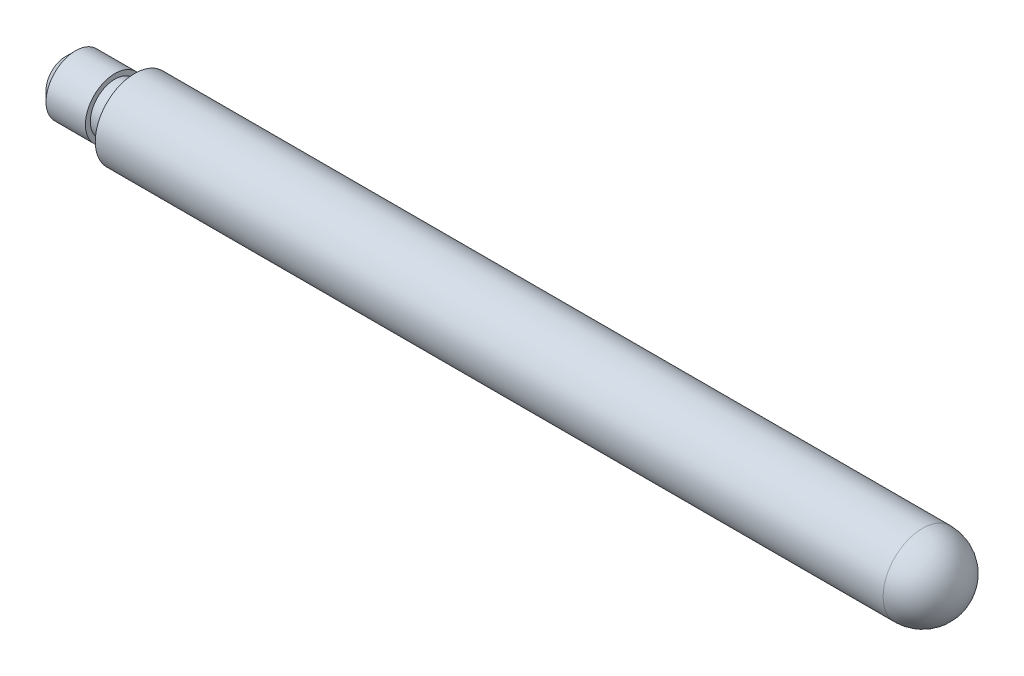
from build123d import *

# Parameters (mm, degrees)
CHAMFER_2_SIZE = 1


with BuildPart() as part:
    # Sketch 1 → Revolve 1 (revolve)
    with BuildSketch(Plane(origin=(0, 0, 0), x_dir=(1, 0, 0), z_dir=(0, 1, 0)), mode=Mode.PRIVATE) as revolve_1_sk:
        with BuildLine():
            Line((-47.5616, 0), (-47.5616, 3))
            Line((-47.5616, 3), (-42.5616, 3))
            Line((-42.5616, 3), (-42.5616, 2.5))
            Line((-42.5616, 2.5), (-40.5616, 2.5))
            Line((-40.5616, 2.5), (-40.5616, 4))
            Line((-40.5616, 4), (39.4384, 4))
            ThreePointArc((39.4384, 4), (42.266827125, 2.828427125), (43.4384, 0))
            Line((43.4384, 0), (-47.5616, 0))
        make_face()
    revolve(revolve_1_sk.sketch.rotate(Axis((-47.5616, 0, 0), (1, 0, 0)), 180), axis=Axis((-47.5616, 0, 0), (1, 0, 0)))

    # Chamfer 2
    chamfer_2_edges = [part.edges().sort_by_distance(p)[0] for p in [
        (-47.5616, 0, -3),
    ]]
    chamfer(chamfer_2_edges, length=CHAMFER_2_SIZE)


solid = part.part
